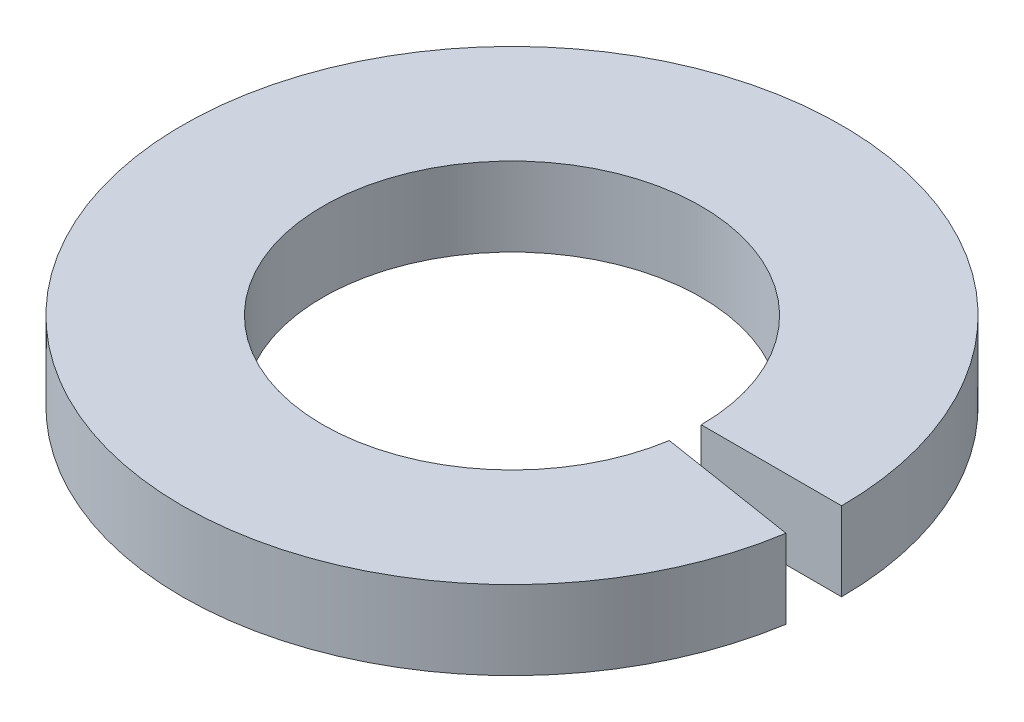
ISO-10303-21;
HEADER;
FILE_DESCRIPTION(('STEP AP214'),'2;1');
FILE_NAME('part.step','',(''),(''),'','','');
FILE_SCHEMA(('AUTOMOTIVE_DESIGN { 1 0 10303 214 1 1 1 1 }'));
ENDSEC;
DATA;
#1=APPLICATION_CONTEXT('core data for automotive mechanical design processes');
#2=APPLICATION_PROTOCOL_DEFINITION('international standard','automotive_design',2000,#1);
#3=PRODUCT_CONTEXT('',#1,'mechanical');
#4=PRODUCT('Part','Part','',(#3));
#5=PRODUCT_RELATED_PRODUCT_CATEGORY('part','',(#4));
#6=PRODUCT_DEFINITION_FORMATION('','',#4);
#7=PRODUCT_DEFINITION_CONTEXT('part definition',#1,'design');
#8=PRODUCT_DEFINITION('design','',#6,#7);
#9=PRODUCT_DEFINITION_SHAPE('','',#8);
#10=(LENGTH_UNIT() NAMED_UNIT(*) SI_UNIT(.MILLI.,.METRE.));
#11=(NAMED_UNIT(*) PLANE_ANGLE_UNIT() SI_UNIT($,.RADIAN.));
#12=(NAMED_UNIT(*) SI_UNIT($,.STERADIAN.) SOLID_ANGLE_UNIT());
#13=UNCERTAINTY_MEASURE_WITH_UNIT(LENGTH_MEASURE(1.E-05),#10,'distance_accuracy_value','');
#14=(GEOMETRIC_REPRESENTATION_CONTEXT(3) GLOBAL_UNCERTAINTY_ASSIGNED_CONTEXT((#13)) GLOBAL_UNIT_ASSIGNED_CONTEXT((#10,
#11,#12)) REPRESENTATION_CONTEXT('',''));
#15=CARTESIAN_POINT('',(0.,0.,0.));
#16=DIRECTION('',(0.,0.,1.));
#17=DIRECTION('',(1.,0.,0.));
#18=AXIS2_PLACEMENT_3D('',#15,#16,#17);
#19=CARTESIAN_POINT('',(2.62162116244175,9.99200722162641E-13,0.415224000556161));
#20=DIRECTION('',(0.,-1.00000000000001,0.));
#21=DIRECTION('',(0.,0.,-0.999999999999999));
#22=AXIS2_PLACEMENT_3D('',#19,#20,#21);
#23=PLANE('',#22);
#24=CARTESIAN_POINT('',(0.,-6.66133814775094E-13,0.));
#25=DIRECTION('',(0.,-1.00000000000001,0.));
#26=DIRECTION('',(0.,0.,-0.999999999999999));
#27=AXIS2_PLACEMENT_3D('',#24,#25,#26);
#28=CIRCLE('',#27,1.524);
#29=CARTESIAN_POINT('',(1.50523703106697,-7.7715611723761E-13,0.238406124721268));
#30=VERTEX_POINT('',#29);
#31=CARTESIAN_POINT('',(1.52399999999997,-4.44089209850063E-13,-1.31838984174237E-13));
#32=VERTEX_POINT('',#31);
#33=EDGE_CURVE('E11',#30,#32,#28,.T.);
#34=ORIENTED_EDGE('',*,*,#33,.F.);
#35=DIRECTION('',(0.987688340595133,0.,0.156434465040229));
#36=VECTOR('',#35,1.);
#37=CARTESIAN_POINT('',(2.62162116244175,9.99200722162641E-13,0.415224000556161));
#38=LINE('',#37,#36);
#39=CARTESIAN_POINT('',(2.62162116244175,9.99200722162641E-13,0.415224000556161));
#40=VERTEX_POINT('',#39);
#41=EDGE_CURVE('E73',#30,#40,#38,.T.);
#42=ORIENTED_EDGE('',*,*,#41,.T.);
#43=CARTESIAN_POINT('',(0.,-6.66133814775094E-13,0.));
#44=DIRECTION('',(0.,-1.00000000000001,0.));
#45=DIRECTION('',(0.,0.,-0.999999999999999));
#46=AXIS2_PLACEMENT_3D('',#43,#44,#45);
#47=CIRCLE('',#46,2.6543);
#48=CARTESIAN_POINT('',(2.65430000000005,-9.99200722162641E-13,1.2490009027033E-13));
#49=VERTEX_POINT('',#48);
#50=EDGE_CURVE('E68',#40,#49,#47,.T.);
#51=ORIENTED_EDGE('',*,*,#50,.T.);
#52=DIRECTION('',(0.999999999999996,0.,0.));
#53=VECTOR('',#52,1.);
#54=CARTESIAN_POINT('',(2.65430000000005,-9.99200722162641E-13,1.2490009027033E-13));
#55=LINE('',#54,#53);
#56=EDGE_CURVE('E71',#32,#49,#55,.T.);
#57=ORIENTED_EDGE('',*,*,#56,.F.);
#58=EDGE_LOOP('',(#34,#42,#51,#57));
#59=FACE_BOUND('',#58,.T.);
#60=ADVANCED_FACE('F32',(#59),#23,.T.);
#61=CARTESIAN_POINT('',(0.,-31.7500000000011,0.));
#62=DIRECTION('',(0.,-1.00000000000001,0.));
#63=DIRECTION('',(0.,0.,-0.999999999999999));
#64=AXIS2_PLACEMENT_3D('',#61,#62,#63);
#65=CYLINDRICAL_SURFACE('',#64,1.524);
#66=CARTESIAN_POINT('',(0.,0.634999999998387,-1.00613961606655E-13));
#67=DIRECTION('',(0.,-1.00000000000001,0.));
#68=DIRECTION('',(0.,0.,-0.999999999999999));
#69=AXIS2_PLACEMENT_3D('',#66,#67,#68);
#70=CIRCLE('',#69,1.524);
#71=CARTESIAN_POINT('',(1.50523703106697,0.634999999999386,0.238406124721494));
#72=VERTEX_POINT('',#71);
#73=CARTESIAN_POINT('',(1.52399999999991,0.635000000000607,0.));
#74=VERTEX_POINT('',#73);
#75=EDGE_CURVE('E40',#72,#74,#70,.T.);
#76=ORIENTED_EDGE('',*,*,#75,.F.);
#77=DIRECTION('',(0.,-1.00000000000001,0.));
#78=VECTOR('',#77,1.);
#79=CARTESIAN_POINT('',(1.50523703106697,-7.7715611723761E-13,0.238406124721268));
#80=LINE('',#79,#78);
#81=EDGE_CURVE('E78',#72,#30,#80,.T.);
#82=ORIENTED_EDGE('',*,*,#81,.T.);
#83=ORIENTED_EDGE('',*,*,#33,.T.);
#84=DIRECTION('',(0.,-1.00000000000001,0.));
#85=VECTOR('',#84,1.);
#86=CARTESIAN_POINT('',(1.52399999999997,-4.44089209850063E-13,-1.31838984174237E-13));
#87=LINE('',#86,#85);
#88=EDGE_CURVE('E90',#74,#32,#87,.T.);
#89=ORIENTED_EDGE('',*,*,#88,.F.);
#90=EDGE_LOOP('',(#76,#82,#83,#89));
#91=FACE_BOUND('',#90,.T.);
#92=ADVANCED_FACE('F34',(#91),#65,.F.);
#93=CARTESIAN_POINT('',(1.50523703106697,0.634999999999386,0.238406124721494));
#94=DIRECTION('',(0.,1.00000000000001,0.));
#95=DIRECTION('',(0.,0.,0.999999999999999));
#96=AXIS2_PLACEMENT_3D('',#93,#94,#95);
#97=PLANE('',#96);
#98=CARTESIAN_POINT('',(0.,0.634999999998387,-1.00613961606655E-13));
#99=DIRECTION('',(0.,-1.00000000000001,0.));
#100=DIRECTION('',(0.,0.,-0.999999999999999));
#101=AXIS2_PLACEMENT_3D('',#98,#99,#100);
#102=CIRCLE('',#101,2.6543);
#103=CARTESIAN_POINT('',(2.62162116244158,0.634999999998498,0.415224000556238));
#104=VERTEX_POINT('',#103);
#105=CARTESIAN_POINT('',(2.65430000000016,0.635000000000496,0.));
#106=VERTEX_POINT('',#105);
#107=EDGE_CURVE('E77',#104,#106,#102,.T.);
#108=ORIENTED_EDGE('',*,*,#107,.F.);
#109=DIRECTION('',(-0.987688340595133,0.,-0.156434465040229));
#110=VECTOR('',#109,1.);
#111=CARTESIAN_POINT('',(1.50523703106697,0.634999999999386,0.238406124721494));
#112=LINE('',#111,#110);
#113=EDGE_CURVE('E98',#104,#72,#112,.T.);
#114=ORIENTED_EDGE('',*,*,#113,.T.);
#115=ORIENTED_EDGE('',*,*,#75,.T.);
#116=DIRECTION('',(-0.999999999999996,0.,0.));
#117=VECTOR('',#116,1.);
#118=CARTESIAN_POINT('',(1.52399999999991,0.635000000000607,0.));
#119=LINE('',#118,#117);
#120=EDGE_CURVE('E86',#106,#74,#119,.T.);
#121=ORIENTED_EDGE('',*,*,#120,.F.);
#122=EDGE_LOOP('',(#108,#114,#115,#121));
#123=FACE_BOUND('',#122,.T.);
#124=ADVANCED_FACE('F102',(#123),#97,.T.);
#125=CARTESIAN_POINT('',(0.,-31.7500000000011,0.));
#126=DIRECTION('',(0.,-1.00000000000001,0.));
#127=DIRECTION('',(0.,0.,-0.999999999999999));
#128=AXIS2_PLACEMENT_3D('',#125,#126,#127);
#129=CYLINDRICAL_SURFACE('',#128,2.6543);
#130=DIRECTION('',(0.,1.00000000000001,0.));
#131=VECTOR('',#130,1.);
#132=CARTESIAN_POINT('',(2.62162116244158,0.634999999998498,0.415224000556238));
#133=LINE('',#132,#131);
#134=EDGE_CURVE('E96',#40,#104,#133,.T.);
#135=ORIENTED_EDGE('',*,*,#134,.T.);
#136=ORIENTED_EDGE('',*,*,#107,.T.);
#137=DIRECTION('',(0.,1.00000000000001,0.));
#138=VECTOR('',#137,1.);
#139=CARTESIAN_POINT('',(2.65430000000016,0.635000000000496,0.));
#140=LINE('',#139,#138);
#141=EDGE_CURVE('E81',#49,#106,#140,.T.);
#142=ORIENTED_EDGE('',*,*,#141,.F.);
#143=ORIENTED_EDGE('',*,*,#50,.F.);
#144=EDGE_LOOP('',(#135,#136,#142,#143));
#145=FACE_BOUND('',#144,.T.);
#146=ADVANCED_FACE('F82',(#145),#129,.T.);
#147=CARTESIAN_POINT('',(1.50523703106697,-7.7715611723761E-13,0.238406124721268));
#148=DIRECTION('',(0.156434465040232,0.,-0.987688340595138));
#149=DIRECTION('',(-0.987688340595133,0.,-0.156434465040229));
#150=AXIS2_PLACEMENT_3D('',#147,#148,#149);
#151=PLANE('',#150);
#152=ORIENTED_EDGE('',*,*,#41,.F.);
#153=ORIENTED_EDGE('',*,*,#81,.F.);
#154=ORIENTED_EDGE('',*,*,#113,.F.);
#155=ORIENTED_EDGE('',*,*,#134,.F.);
#156=EDGE_LOOP('',(#152,#153,#154,#155));
#157=FACE_BOUND('',#156,.T.);
#158=ADVANCED_FACE('F106',(#157),#151,.T.);
#159=CARTESIAN_POINT('',(1.52399999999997,-4.44089209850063E-13,-1.31838984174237E-13));
#160=DIRECTION('',(0.,0.,-0.999999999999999));
#161=DIRECTION('',(-0.999999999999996,0.,0.));
#162=AXIS2_PLACEMENT_3D('',#159,#160,#161);
#163=PLANE('',#162);
#164=ORIENTED_EDGE('',*,*,#56,.T.);
#165=ORIENTED_EDGE('',*,*,#141,.T.);
#166=ORIENTED_EDGE('',*,*,#120,.T.);
#167=ORIENTED_EDGE('',*,*,#88,.T.);
#168=EDGE_LOOP('',(#164,#165,#166,#167));
#169=FACE_BOUND('',#168,.T.);
#170=ADVANCED_FACE('F89',(#169),#163,.F.);
#171=CLOSED_SHELL('',(#60,#92,#124,#146,#158,#170));
#172=MANIFOLD_SOLID_BREP('B2',#171);
#173=ADVANCED_BREP_SHAPE_REPRESENTATION('',(#18,#172),#14);
#174=SHAPE_DEFINITION_REPRESENTATION(#9,#173);
ENDSEC;
END-ISO-10303-21;
